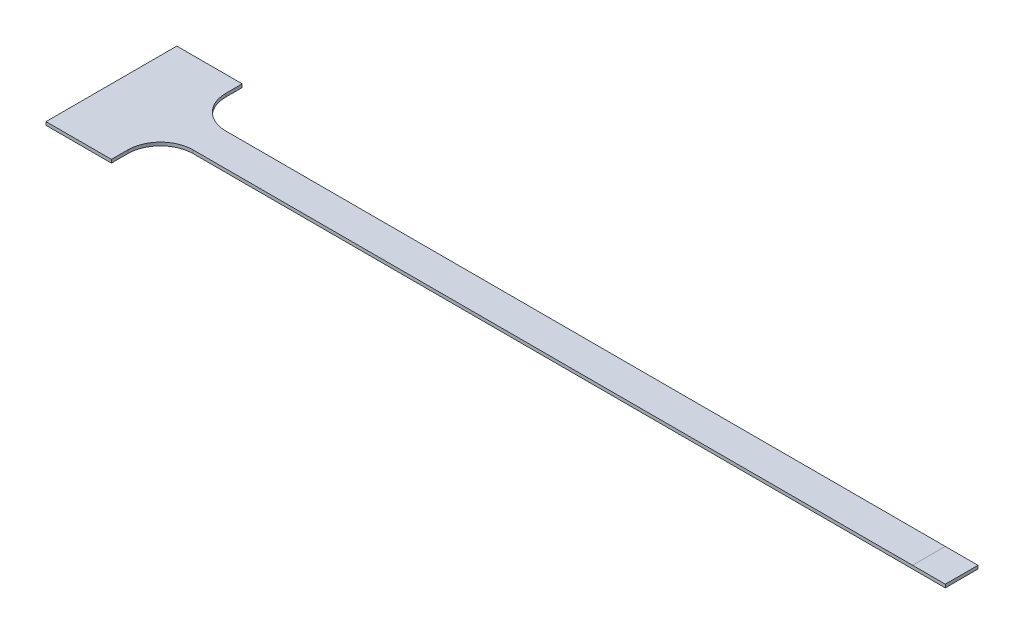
from build123d import *

# Parameters (mm, degrees)
SKETCH1_W      = 20
SKETCH1_H      = 2
EXTRUDE1_DEPTH = 480
SKETCH2_W      = 80
SKETCH2_H      = 2
EXTRUDE2_DEPTH = 40
FILLET1_R      = 20


with BuildPart() as part:
    # Sketch1 → Extrude1 (new body)
    with BuildSketch(Plane(origin=(0, 0, 0), x_dir=(0, 0, -1), z_dir=(1, 0, 0))):
        Rectangle(SKETCH1_W, SKETCH1_H)
    extrude(amount=-EXTRUDE1_DEPTH)

    # Sketch2 → Extrude2 (add)
    with BuildSketch(Plane.ZY.offset(480)):
        Rectangle(SKETCH2_W, SKETCH2_H)
    extrude(amount=EXTRUDE2_DEPTH)

    # Fillet1
    fillet1_edges = [part.edges().sort_by_distance(p)[0] for p in [
        (-480, 0, 10),
        (-480, 0, -10),
    ]]
    fillet(fillet1_edges, radius=FILLET1_R)


solid = part.part
